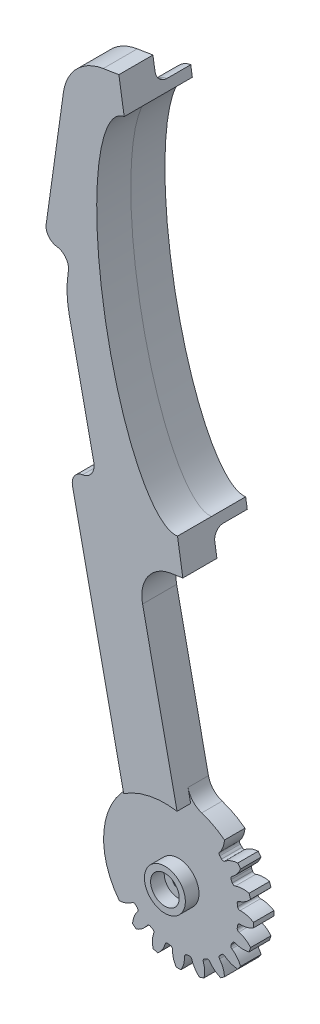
from build123d import *

# Parameters (mm, degrees)
BOSS_EXTRU_1_DEPTH                 = 5
CONG_1_R                           = 0.35
R_P_TITION_CIRCULAIRE4_COUNT       = 20
CONG_1_OF_R_P_TITION_CIRCULAIRE4_R = 0.35
BOSS_EXTRU_2_START                 = -5
BOSS_EXTRU_2_DEPTH                 = 5
ENL_V_START                        = -2
ESQUISSE7_R                        = 10.999999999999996
ENL_V_MAT_EXTRU_1_DEPTH            = 2
ESQUISSE8_R                        = 3
BOSS_EXTRU_3_DEPTH                 = 2
ESQUISSE9_R                        = 4.4
BOSS_EXTRU_4_DEPTH                 = 2.5
CONG_2_R                           = 3
CONG_4_R                           = 1
ESQUISSE11_R                       = 2.1
ENL_V_MAT_EXTRU_2_DEPTH            = 2
ESQUISSE12_R                       = 0.9
ENL_V_MAT_EXTRU_3_DEPTH            = 3
BOSS_EXTRU_5_DEPTH                 = 5
CONG_5_R                           = 1.5


with BuildPart() as part:
    # Esquisse3 → Boss.-Extru.1 (new body)
    with BuildSketch(Plane.XY):
        with BuildLine():
            Line((-2.747508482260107, 8.081920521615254), (-1.378706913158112, -0.560352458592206))
            Line((-1.378706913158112, -0.560352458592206), (-0.00990534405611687, 8.081920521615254))
            ThreePointArc((-0.00990534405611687, 8.081920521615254), (-0.2670475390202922, 8.118743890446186), (-0.5251694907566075, 8.147917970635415))
            ThreePointArc((-0.5251694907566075, 8.147917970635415), (-0.5770568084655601, 9.335581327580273), (-1.0313246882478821, 10.434160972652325))
            ThreePointArc((-1.0313246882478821, 10.434160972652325), (-1.3787069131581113, 10.439647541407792), (-1.7260891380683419, 10.434160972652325))
            ThreePointArc((-1.7260891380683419, 10.434160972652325), (-2.180357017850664, 9.335581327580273), (-2.2322443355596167, 8.147917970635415))
            ThreePointArc((-2.2322443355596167, 8.147917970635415), (-2.4903662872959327, 8.118743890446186), (-2.747508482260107, 8.081920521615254))
        make_face()
    boss_extru_1 = extrude(amount=BOSS_EXTRU_1_DEPTH)

    # Cong_1
    cong_1_edges = [part.edges().sort_by_distance(p)[0] for p in [
        (-2.232244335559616, 8.147917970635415, 2.5),
        (-0.5251694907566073, 8.147917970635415, 2.5),
    ]]
    fillet(cong_1_edges, radius=CONG_1_R)

    # R_p_tition circulaire4: Boss.-Extru.1 ×20 about axis
    r_p_tition_circulaire4_axis = Axis((-1.3787069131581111, -0.5603524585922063, 0), (0, 0, 1))
    for i in range(1, R_P_TITION_CIRCULAIRE4_COUNT):
        add(boss_extru_1.rotate(r_p_tition_circulaire4_axis, i * 360 / R_P_TITION_CIRCULAIRE4_COUNT))

    # Cong_1 of R_p_tition circulaire4
    cong_1_of_r_p_tition_circulaire4_edges = [part.edges().sort_by_distance(p)[0] for p in [
        (-4.8814727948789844, 7.4579473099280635, 2.5),
        (-3.2579481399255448, 7.98546244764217, 2.5),
        (-7.187826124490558, 5.983089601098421, 2.5),
        (-5.806773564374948, 6.986483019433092, 2.5),
        (-8.925542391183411, 3.867714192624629, 2.5),
        (-7.92214897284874, 5.248766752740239, 2.5),
        (-9.924521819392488, 1.3188887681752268, 2.5),
        (-9.39700668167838, 2.942413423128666, 2.5),
        (-10.086977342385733, -1.413889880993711, 2.5),
        (-10.086977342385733, 0.2931849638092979, 2.5),
        (-9.397006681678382, -4.063118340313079, 2.5),
        (-9.924521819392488, -2.439593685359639, 2.5),
        (-7.922148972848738, -6.369471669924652, 2.4999999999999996),
        (-8.92554239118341, -4.988419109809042, 2.4999999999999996),
        (-5.806773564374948, -8.107187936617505, 2.5),
        (-7.187826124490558, -7.103794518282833, 2.5),
        (-3.2579481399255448, -9.106167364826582, 2.5),
        (-4.8814727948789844, -8.578652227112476, 2.5),
        (-0.5251694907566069, -9.268622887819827, 2.5),
        (-2.2322443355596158, -9.268622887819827, 2.5),
        (2.124058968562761, -8.578652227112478, 2.5),
        (0.5005343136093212, -9.106167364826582, 2.5),
        (4.4304122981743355, -7.103794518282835, 2.4999999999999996),
        (3.0493597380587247, -8.107187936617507, 2.4999999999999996),
        (6.168128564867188, -4.988419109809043, 2.5),
        (5.164735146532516, -6.3694716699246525, 2.5),
        (7.167107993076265, -2.4395936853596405, 2.4999999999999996),
        (6.639592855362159, -4.06311834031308, 2.4999999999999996),
        (7.32956351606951, 0.29318496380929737, 2.5),
        (7.32956351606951, -1.4138898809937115, 2.5),
        (6.639592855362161, 2.9424134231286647, 2.5),
        (7.167107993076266, 1.3188887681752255, 2.5),
        (5.164735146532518, 5.248766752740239, 2.5),
        (6.168128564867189, 3.8677141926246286, 2.5),
        (3.0493597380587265, 6.986483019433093, 2.5),
        (4.4304122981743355, 5.9830896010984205, 2.5),
        (0.5005343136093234, 7.98546244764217, 2.5),
        (2.1240589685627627, 7.4579473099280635, 2.5),
    ]]
    fillet(cong_1_of_r_p_tition_circulaire4_edges, radius=CONG_1_OF_R_P_TITION_CIRCULAIRE4_R)

    # Esquisse6 → Boss.-Extru.2 (add)
    with BuildSketch(Plane.XY.offset(5).offset(BOSS_EXTRU_2_START)):
        with BuildLine():
            Line((1.2531095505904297, 40.35509135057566), (0.4709372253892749, 45.29353305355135))
            add(Edge.make_bspline(
                [(-7.350786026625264, 94.67795008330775), (-14.264604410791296, 93.58290882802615), (-10.353742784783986, 68.89070031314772), (-6.442881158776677, 44.19849179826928), (0.4709372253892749, 45.29353305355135)],
                knots=[-1.776e-14, -1.776e-14, -1.776e-14, 1.5707963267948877, 1.5707963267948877, 3.141592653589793, 3.141592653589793, 3.141592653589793], degree=2, weights=[1, 0.7071067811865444, 1, 0.7071067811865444, 1]))
            Line((-7.350786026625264, 94.67795008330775), (-8.13295835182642, 99.61639178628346))
            Line((-8.13295835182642, 99.61639178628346), (-10.426751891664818, 99.25309058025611))
            ThreePointArc((-10.426751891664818, 99.25309058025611), (-14.324463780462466, 97.24563704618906), (-16.263587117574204, 93.31348390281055))
            Line((-16.263587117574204, 93.31348390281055), (-18.79931174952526, 75.27086563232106))
            ThreePointArc((-18.79931174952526, 75.27086563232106), (-18.45437314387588, 73.9370870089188), (-17.26734080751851, 73.23787152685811))
            Line((-17.26734080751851, 73.23787152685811), (-17.237168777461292, 73.23363112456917))
            ThreePointArc((-17.237168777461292, 73.23363112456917), (-15.918243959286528, 72.45672503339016), (-15.53497884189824, 70.97474878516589))
            Line((-15.53497884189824, 70.97474878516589), (-15.584398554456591, 70.62310925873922))
            ThreePointArc((-15.584398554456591, 70.62310925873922), (-15.721239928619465, 68.01202029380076), (-15.402591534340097, 65.41683738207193))
            Line((-15.402591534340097, 65.41683738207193), (-11.810350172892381, 48.51667051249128))
            ThreePointArc((-11.810350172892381, 48.51667051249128), (-12.118392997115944, 46.968034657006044), (-13.453776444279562, 46.12547044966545))
            Line((-13.453776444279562, 46.12547044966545), (-13.454887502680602, 46.12529447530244))
            ThreePointArc((-13.454887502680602, 46.12529447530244), (-14.65673260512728, 45.366986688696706), (-14.933971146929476, 43.97321441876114))
            Line((-14.933971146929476, 43.97321441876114), (-7.421758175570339, 8.631031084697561))
            ThreePointArc((-7.421758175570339, 8.631031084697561), (-12.200130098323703, 1.4136790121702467), (-10.277893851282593, -7.025990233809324))
            Line((-10.277893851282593, -7.025990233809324), (-1.378706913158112, -0.560352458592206))
            Line((-1.378706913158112, -0.560352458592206), (5.086930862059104, 8.338834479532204))
            ThreePointArc((5.086930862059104, 8.338834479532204), (2.859500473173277, 9.590391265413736), (0.40342263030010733, 10.294324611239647))
            Line((0.40342263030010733, 10.294324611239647), (-4.656020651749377, 34.09713381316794))
            ThreePointArc((-4.656020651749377, 34.09713381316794), (-3.8818841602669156, 37.97457739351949), (-0.5334134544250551, 40.077337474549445))
            Line((-0.5334134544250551, 40.077337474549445), (1.2531095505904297, 40.35509135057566))
        make_face()
    extrude(amount=BOSS_EXTRU_2_DEPTH)

    # Esquisse7 → Enl_v. mat.-Extru.1 (cut)
    with BuildSketch(Plane.XY.offset(5).offset(ENL_V_START)):
        with Locations((-1.378706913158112, -0.560352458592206)):
            Circle(ESQUISSE7_R)
    extrude(amount=ENL_V_MAT_EXTRU_1_DEPTH, mode=Mode.SUBTRACT)

    # Esquisse8 → Boss.-Extru.3 (add)
    with BuildSketch(Plane.XY.offset(3)):
        with Locations((-1.378706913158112, -0.560352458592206)):
            Circle(ESQUISSE8_R)
    extrude(amount=BOSS_EXTRU_3_DEPTH)

    # Esquisse9 → Boss.-Extru.4 (add)
    with BuildSketch(Plane(origin=(0, 0, 0), x_dir=(-1, 0, 0), z_dir=(0, 0, -1))):
        with Locations(Location((1.378706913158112, -0.560352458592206, 0), (0, 0, 180))):
            Circle(ESQUISSE9_R)
        with BuildLine():
            Line((1.1787069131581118, 1.7811214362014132), (1.3787069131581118, 1.5396475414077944))
            Line((1.3787069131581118, 1.5396475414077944), (1.5787069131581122, 1.7811214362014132))
            ThreePointArc((1.5787069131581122, 1.7811214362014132), (1.9869316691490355, 1.709573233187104), (2.3762387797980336, 1.5674234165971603))
            Line((2.3762387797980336, 1.5674234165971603), (2.428706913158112, 1.2583008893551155))
            Line((2.428706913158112, 1.2583008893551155), (2.7226489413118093, 1.3674234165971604))
            ThreePointArc((2.7226489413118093, 1.3674234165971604), (3.040407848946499, 1.1013484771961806), (3.3064827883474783, 0.7835895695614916))
            Line((3.3064827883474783, 0.7835895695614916), (3.197360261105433, 0.48964754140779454))
            Line((3.197360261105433, 0.48964754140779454), (3.506482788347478, 0.43717940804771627))
            ThreePointArc((3.506482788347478, 0.43717940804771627), (3.6486326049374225, 0.04787229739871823), (3.7201808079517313, -0.3603524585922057))
            Line((3.7201808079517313, -0.3603524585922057), (3.478706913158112, -0.5603524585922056))
            Line((3.478706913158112, -0.5603524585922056), (3.720180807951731, -0.7603524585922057))
            ThreePointArc((3.720180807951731, -0.7603524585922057), (3.6486326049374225, -1.1685772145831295), (3.5064827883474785, -1.5578843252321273))
            Line((3.5064827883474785, -1.5578843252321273), (3.1973602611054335, -1.6103524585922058))
            Line((3.1973602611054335, -1.6103524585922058), (3.3064827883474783, -1.904294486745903))
            ThreePointArc((3.3064827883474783, -1.904294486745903), (3.040407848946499, -2.222053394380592), (2.72264894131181, -2.4881283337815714))
            Line((2.72264894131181, -2.4881283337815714), (2.4287069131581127, -2.3790058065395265))
            Line((2.4287069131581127, -2.3790058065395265), (2.3762387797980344, -2.6881283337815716))
            ThreePointArc((2.3762387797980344, -2.6881283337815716), (1.9869316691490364, -2.8302781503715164), (1.5787069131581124, -2.9018263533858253))
            Line((1.5787069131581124, -2.9018263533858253), (1.3787069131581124, -2.660352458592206))
            Line((1.3787069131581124, -2.660352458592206), (1.178706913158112, -2.9018263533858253))
            ThreePointArc((1.178706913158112, -2.9018263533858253), (0.770482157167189, -2.830278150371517), (0.38117504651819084, -2.6881283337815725))
            Line((0.38117504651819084, -2.6881283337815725), (0.32870691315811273, -2.3790058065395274))
            Line((0.32870691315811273, -2.3790058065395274), (0.0347648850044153, -2.4881283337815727))
            ThreePointArc((0.0347648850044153, -2.4881283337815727), (-0.28299402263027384, -2.222053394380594), (-0.5490689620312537, -1.904294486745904))
            Line((-0.5490689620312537, -1.904294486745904), (-0.43994643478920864, -1.6103524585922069))
            Line((-0.43994643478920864, -1.6103524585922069), (-0.7490689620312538, -1.5578843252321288))
            ThreePointArc((-0.7490689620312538, -1.5578843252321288), (-0.891218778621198, -1.1685772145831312), (-0.9627669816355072, -0.7603524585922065))
            Line((-0.9627669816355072, -0.7603524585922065), (-0.7212930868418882, -0.5603524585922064))
            Line((-0.7212930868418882, -0.5603524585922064), (-0.9627669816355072, -0.36035245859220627))
            ThreePointArc((-0.9627669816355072, -0.36035245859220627), (-0.8912187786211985, 0.04787229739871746), (-0.7490689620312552, 0.4371794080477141))
            Line((-0.7490689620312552, 0.4371794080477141), (-0.4399464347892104, 0.48964754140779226))
            Line((-0.4399464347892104, 0.48964754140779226), (-0.5490689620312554, 0.7835895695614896))
            ThreePointArc((-0.5490689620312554, 0.7835895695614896), (-0.28299402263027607, 1.1013484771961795), (0.03476488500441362, 1.3674234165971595))
            Line((0.03476488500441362, 1.3674234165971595), (0.3287069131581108, 1.2583008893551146))
            Line((0.3287069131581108, 1.2583008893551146), (0.3811750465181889, 1.5674234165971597))
            ThreePointArc((0.3811750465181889, 1.5674234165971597), (0.7704821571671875, 1.7095732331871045), (1.1787069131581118, 1.7811214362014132))
        make_face(mode=Mode.SUBTRACT)
    extrude(amount=BOSS_EXTRU_4_DEPTH)

    # Cong_2
    cong_2_edges = [part.edges().sort_by_distance(p)[0] for p in [
        (0.4034226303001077, 10.294324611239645, 1.5),
        (-7.421758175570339, 8.631031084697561, 1.5),
    ]]
    fillet(cong_2_edges, radius=CONG_2_R)

    # Cong_4
    cong_4_edges = [part.edges().sort_by_distance(p)[0] for p in [
        (-5.778706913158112, -0.5603524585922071, 0),
    ]]
    fillet(cong_4_edges, radius=CONG_4_R)

    # Esquisse11 → Enl_v. mat.-Extru.2 (cut)
    with BuildSketch(Plane.XY.offset(5)):
        with Locations((-1.378706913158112, -0.560352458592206)):
            Circle(ESQUISSE11_R)
    extrude(amount=-ENL_V_MAT_EXTRU_2_DEPTH, mode=Mode.SUBTRACT)

    # Esquisse12 → Enl_v. mat.-Extru.3 (cut)
    with BuildSketch(Plane.XY.offset(3)):
        with Locations((-1.378706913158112, -0.560352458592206)):
            Circle(ESQUISSE12_R)
    extrude(amount=-ENL_V_MAT_EXTRU_3_DEPTH, mode=Mode.SUBTRACT)

    # Esquisse13 → Boss.-Extru.5 (add)
    with BuildSketch(Plane(origin=(0, 0, 0), x_dir=(-1, 0, 0), z_dir=(0, 0, -1))):
        with BuildLine():
            Line((-0.705588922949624, 43.81200054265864), (-0.47093722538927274, 45.293533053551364))
            add(Edge.make_bspline(
                [(-0.47093722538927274, 45.293533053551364), (6.442881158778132, 44.19849179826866), (10.353742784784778, 68.8907003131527), (14.26460441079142, 93.58290882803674), (7.350786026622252, 94.67795008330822)],
                knots=[3.1415926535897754, 3.1415926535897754, 3.1415926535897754, 4.712388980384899, 4.712388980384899, 6.283185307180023, 6.283185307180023, 6.283185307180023], degree=2, weights=[1, 0.7071067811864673, 1, 0.7071067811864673, 1]))
            Line((7.350786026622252, 94.67795008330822), (7.585437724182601, 96.15948259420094))
            add(Edge.make_bspline(
                [(-0.705588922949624, 43.81200054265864), (7.689761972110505, 42.48230758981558), (11.835275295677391, 68.6560486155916), (15.98078861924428, 94.82978964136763), (7.585437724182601, 96.15948259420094)],
                knots=[3.1415926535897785, 3.1415926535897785, 3.1415926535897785, 4.712388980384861, 4.712388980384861, 6.283185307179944, 6.283185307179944, 6.283185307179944], degree=2, weights=[1, 0.7071067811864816, 1, 0.7071067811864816, 1]))
        make_face()
    extrude(amount=BOSS_EXTRU_5_DEPTH)

    # Cong_5
    cong_5_edges = [part.edges().sort_by_distance(p)[0] for p in [
        (-11.835275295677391, 68.6560486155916, 0),
    ]]
    fillet(cong_5_edges, radius=CONG_5_R)


solid = part.part
